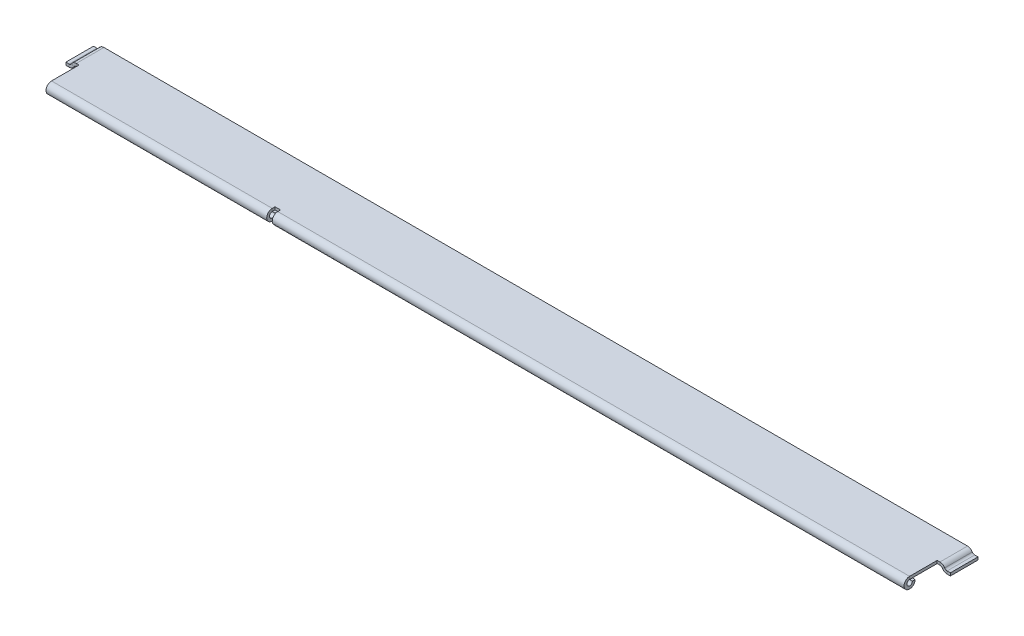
ISO-10303-21;
HEADER;
FILE_DESCRIPTION(('STEP AP214'),'2;1');
FILE_NAME('part.step','',(''),(''),'','','');
FILE_SCHEMA(('AUTOMOTIVE_DESIGN { 1 0 10303 214 1 1 1 1 }'));
ENDSEC;
DATA;
#1=APPLICATION_CONTEXT('core data for automotive mechanical design processes');
#2=APPLICATION_PROTOCOL_DEFINITION('international standard','automotive_design',2000,#1);
#3=PRODUCT_CONTEXT('',#1,'mechanical');
#4=PRODUCT('Part','Part','',(#3));
#5=PRODUCT_RELATED_PRODUCT_CATEGORY('part','',(#4));
#6=PRODUCT_DEFINITION_FORMATION('','',#4);
#7=PRODUCT_DEFINITION_CONTEXT('part definition',#1,'design');
#8=PRODUCT_DEFINITION('design','',#6,#7);
#9=PRODUCT_DEFINITION_SHAPE('','',#8);
#10=(LENGTH_UNIT() NAMED_UNIT(*) SI_UNIT(.MILLI.,.METRE.));
#11=(NAMED_UNIT(*) PLANE_ANGLE_UNIT() SI_UNIT($,.RADIAN.));
#12=(NAMED_UNIT(*) SI_UNIT($,.STERADIAN.) SOLID_ANGLE_UNIT());
#13=UNCERTAINTY_MEASURE_WITH_UNIT(LENGTH_MEASURE(1.E-05),#10,'distance_accuracy_value','');
#14=(GEOMETRIC_REPRESENTATION_CONTEXT(3) GLOBAL_UNCERTAINTY_ASSIGNED_CONTEXT((#13)) GLOBAL_UNIT_ASSIGNED_CONTEXT((#10,
#11,#12)) REPRESENTATION_CONTEXT('',''));
#15=CARTESIAN_POINT('',(0.,0.,0.));
#16=DIRECTION('',(0.,0.,1.));
#17=DIRECTION('',(1.,0.,0.));
#18=AXIS2_PLACEMENT_3D('',#15,#16,#17);
#19=CARTESIAN_POINT('',(155.5,1.,-11.));
#20=DIRECTION('',(0.,-1.,0.));
#21=DIRECTION('',(0.,0.,-1.));
#22=AXIS2_PLACEMENT_3D('',#19,#20,#21);
#23=PLANE('',#22);
#24=DIRECTION('',(0.,0.,-1.));
#25=VECTOR('',#24,1.);
#26=CARTESIAN_POINT('',(-73.5,1.,8.));
#27=LINE('',#26,#25);
#28=CARTESIAN_POINT('',(-73.5,0.999999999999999,9.));
#29=VERTEX_POINT('',#28);
#30=CARTESIAN_POINT('',(-73.5,1.,8.));
#31=VERTEX_POINT('',#30);
#32=EDGE_CURVE('E504',#29,#31,#27,.T.);
#33=ORIENTED_EDGE('',*,*,#32,.F.);
#34=DIRECTION('',(-1.,0.,0.));
#35=VECTOR('',#34,1.);
#36=CARTESIAN_POINT('',(-155.5,0.999999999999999,9.));
#37=LINE('',#36,#35);
#38=CARTESIAN_POINT('',(155.5,0.999999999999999,9.));
#39=VERTEX_POINT('',#38);
#40=EDGE_CURVE('E325',#29,#39,#37,.F.);
#41=ORIENTED_EDGE('',*,*,#40,.T.);
#42=DIRECTION('',(0.,0.,-1.));
#43=VECTOR('',#42,1.);
#44=CARTESIAN_POINT('',(155.5,1.,11.));
#45=LINE('',#44,#43);
#46=CARTESIAN_POINT('',(155.5,1.,-0.999999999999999));
#47=VERTEX_POINT('',#46);
#48=EDGE_CURVE('E330',#39,#47,#45,.T.);
#49=ORIENTED_EDGE('',*,*,#48,.T.);
#50=DIRECTION('',(-1.,0.,0.));
#51=VECTOR('',#50,1.);
#52=CARTESIAN_POINT('',(160.3,1.,-0.999999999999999));
#53=LINE('',#52,#51);
#54=CARTESIAN_POINT('',(156.505299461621,1.,-0.999999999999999));
#55=VERTEX_POINT('',#54);
#56=EDGE_CURVE('E342',#55,#47,#53,.T.);
#57=ORIENTED_EDGE('',*,*,#56,.F.);
#58=DIRECTION('',(0.,0.,1.));
#59=VECTOR('',#58,1.);
#60=CARTESIAN_POINT('',(156.505299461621,1.,-11.));
#61=LINE('',#60,#59);
#62=CARTESIAN_POINT('',(156.505299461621,1.,-11.));
#63=VERTEX_POINT('',#62);
#64=EDGE_CURVE('E356',#63,#55,#61,.T.);
#65=ORIENTED_EDGE('',*,*,#64,.F.);
#66=DIRECTION('',(-1.,0.,0.));
#67=VECTOR('',#66,1.);
#68=CARTESIAN_POINT('',(-155.5,1.,-11.));
#69=LINE('',#68,#67);
#70=CARTESIAN_POINT('',(-156.505299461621,1.00000000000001,-11.));
#71=VERTEX_POINT('',#70);
#72=EDGE_CURVE('E321',#63,#71,#69,.T.);
#73=ORIENTED_EDGE('',*,*,#72,.T.);
#74=DIRECTION('',(0.,0.,1.));
#75=VECTOR('',#74,1.);
#76=CARTESIAN_POINT('',(-156.505299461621,1.,-11.0000000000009));
#77=LINE('',#76,#75);
#78=CARTESIAN_POINT('',(-156.505299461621,1.00000000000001,-0.999999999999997));
#79=VERTEX_POINT('',#78);
#80=EDGE_CURVE('E404',#71,#79,#77,.T.);
#81=ORIENTED_EDGE('',*,*,#80,.T.);
#82=DIRECTION('',(1.,0.,0.));
#83=VECTOR('',#82,1.);
#84=CARTESIAN_POINT('',(-160.3,1.,-0.999999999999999));
#85=LINE('',#84,#83);
#86=CARTESIAN_POINT('',(-155.5,1.,-0.999999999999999));
#87=VERTEX_POINT('',#86);
#88=EDGE_CURVE('E326',#79,#87,#85,.T.);
#89=ORIENTED_EDGE('',*,*,#88,.T.);
#90=DIRECTION('',(0.,0.,1.));
#91=VECTOR('',#90,1.);
#92=CARTESIAN_POINT('',(-155.5,1.,11.));
#93=LINE('',#92,#91);
#94=CARTESIAN_POINT('',(-155.5,1.,9.));
#95=VERTEX_POINT('',#94);
#96=EDGE_CURVE('E322',#87,#95,#93,.T.);
#97=ORIENTED_EDGE('',*,*,#96,.T.);
#98=CARTESIAN_POINT('',(-75.5,1.,9.));
#99=VERTEX_POINT('',#98);
#100=EDGE_CURVE('E327',#95,#99,#37,.F.);
#101=ORIENTED_EDGE('',*,*,#100,.T.);
#102=DIRECTION('',(0.,0.,1.));
#103=VECTOR('',#102,1.);
#104=CARTESIAN_POINT('',(-75.5,1.,8.));
#105=LINE('',#104,#103);
#106=CARTESIAN_POINT('',(-75.5,1.,8.));
#107=VERTEX_POINT('',#106);
#108=EDGE_CURVE('E510',#107,#99,#105,.T.);
#109=ORIENTED_EDGE('',*,*,#108,.F.);
#110=DIRECTION('',(-1.,0.,0.));
#111=VECTOR('',#110,1.);
#112=CARTESIAN_POINT('',(-75.5,1.,8.));
#113=LINE('',#112,#111);
#114=EDGE_CURVE('E506',#31,#107,#113,.T.);
#115=ORIENTED_EDGE('',*,*,#114,.F.);
#116=EDGE_LOOP('',(#33,#41,#49,#57,#65,#73,#81,#89,#97,#101,#109,#115));
#117=FACE_BOUND('',#116,.T.);
#118=ADVANCED_FACE('F50',(#117),#23,.F.);
#119=CARTESIAN_POINT('',(0.,-1.,8.));
#120=DIRECTION('',(0.,-1.,0.));
#121=DIRECTION('',(-1.,0.,0.));
#122=AXIS2_PLACEMENT_3D('',#119,#120,#121);
#123=PLANE('',#122);
#124=DIRECTION('',(-1.,0.,0.));
#125=VECTOR('',#124,1.);
#126=CARTESIAN_POINT('',(-155.5,-1.,7.));
#127=LINE('',#126,#125);
#128=CARTESIAN_POINT('',(155.5,-1.,7.));
#129=VERTEX_POINT('',#128);
#130=CARTESIAN_POINT('',(-73.5,-1.,7.));
#131=VERTEX_POINT('',#130);
#132=EDGE_CURVE('E274',#129,#131,#127,.T.);
#133=ORIENTED_EDGE('',*,*,#132,.T.);
#134=DIRECTION('',(0.,0.,1.));
#135=VECTOR('',#134,1.);
#136=CARTESIAN_POINT('',(-73.5,-1.,8.));
#137=LINE('',#136,#135);
#138=CARTESIAN_POINT('',(-73.5,-1.,8.));
#139=VERTEX_POINT('',#138);
#140=EDGE_CURVE('E259',#139,#131,#137,.F.);
#141=ORIENTED_EDGE('',*,*,#140,.F.);
#142=DIRECTION('',(-1.,0.,0.));
#143=VECTOR('',#142,1.);
#144=CARTESIAN_POINT('',(-155.5,-1.,8.));
#145=LINE('',#144,#143);
#146=CARTESIAN_POINT('',(155.5,-1.,8.));
#147=VERTEX_POINT('',#146);
#148=EDGE_CURVE('E297',#147,#139,#145,.T.);
#149=ORIENTED_EDGE('',*,*,#148,.F.);
#150=DIRECTION('',(0.,0.,-1.));
#151=VECTOR('',#150,1.);
#152=CARTESIAN_POINT('',(155.5,-1.,8.));
#153=LINE('',#152,#151);
#154=EDGE_CURVE('E275',#147,#129,#153,.T.);
#155=ORIENTED_EDGE('',*,*,#154,.T.);
#156=EDGE_LOOP('',(#133,#141,#149,#155));
#157=FACE_BOUND('',#156,.T.);
#158=ADVANCED_FACE('F486',(#157),#123,.F.);
#159=CARTESIAN_POINT('',(-75.5,-1.,8.));
#160=VERTEX_POINT('',#159);
#161=CARTESIAN_POINT('',(-155.5,-1.,8.));
#162=VERTEX_POINT('',#161);
#163=EDGE_CURVE('E267',#160,#162,#145,.T.);
#164=ORIENTED_EDGE('',*,*,#163,.F.);
#165=DIRECTION('',(0.,0.,1.));
#166=VECTOR('',#165,1.);
#167=CARTESIAN_POINT('',(-75.5,-1.,8.));
#168=LINE('',#167,#166);
#169=CARTESIAN_POINT('',(-75.5,-1.,7.));
#170=VERTEX_POINT('',#169);
#171=EDGE_CURVE('E252',#160,#170,#168,.F.);
#172=ORIENTED_EDGE('',*,*,#171,.T.);
#173=CARTESIAN_POINT('',(-155.5,-1.,7.));
#174=VERTEX_POINT('',#173);
#175=EDGE_CURVE('E265',#170,#174,#127,.T.);
#176=ORIENTED_EDGE('',*,*,#175,.T.);
#177=DIRECTION('',(0.,0.,-1.));
#178=VECTOR('',#177,1.);
#179=CARTESIAN_POINT('',(-155.5,-1.,8.));
#180=LINE('',#179,#178);
#181=EDGE_CURVE('E280',#162,#174,#180,.T.);
#182=ORIENTED_EDGE('',*,*,#181,.F.);
#183=EDGE_LOOP('',(#164,#172,#176,#182));
#184=FACE_BOUND('',#183,.T.);
#185=ADVANCED_FACE('F263',(#184),#123,.F.);
#186=CARTESIAN_POINT('',(-155.5,-1.,9.));
#187=DIRECTION('',(-1.,0.,0.));
#188=DIRECTION('',(0.,0.,-1.));
#189=AXIS2_PLACEMENT_3D('',#186,#187,#188);
#190=CYLINDRICAL_SURFACE('',#189,0.999999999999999);
#191=CARTESIAN_POINT('',(-73.5,-1.,9.));
#192=DIRECTION('',(-1.,0.,0.));
#193=DIRECTION('',(0.,0.,1.));
#194=AXIS2_PLACEMENT_3D('',#191,#192,#193);
#195=CIRCLE('',#194,0.999999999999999);
#196=CARTESIAN_POINT('',(-73.5,0.,9.));
#197=VERTEX_POINT('',#196);
#198=EDGE_CURVE('E492',#139,#197,#195,.T.);
#199=ORIENTED_EDGE('',*,*,#198,.T.);
#200=DIRECTION('',(-1.,0.,0.));
#201=VECTOR('',#200,1.);
#202=CARTESIAN_POINT('',(-155.5,0.,9.));
#203=LINE('',#202,#201);
#204=CARTESIAN_POINT('',(155.5,0.,9.));
#205=VERTEX_POINT('',#204);
#206=EDGE_CURVE('E289',#197,#205,#203,.F.);
#207=ORIENTED_EDGE('',*,*,#206,.T.);
#208=CARTESIAN_POINT('',(155.5,-1.,9.));
#209=DIRECTION('',(-1.,0.,0.));
#210=DIRECTION('',(0.,0.,1.));
#211=AXIS2_PLACEMENT_3D('',#208,#209,#210);
#212=CIRCLE('',#211,0.999999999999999);
#213=EDGE_CURVE('E294',#205,#147,#212,.F.);
#214=ORIENTED_EDGE('',*,*,#213,.T.);
#215=ORIENTED_EDGE('',*,*,#148,.T.);
#216=EDGE_LOOP('',(#199,#207,#214,#215));
#217=FACE_BOUND('',#216,.T.);
#218=ADVANCED_FACE('F489',(#217),#190,.F.);
#219=CARTESIAN_POINT('',(-75.5,-1.,9.));
#220=DIRECTION('',(-1.,0.,0.));
#221=DIRECTION('',(0.,0.,1.));
#222=AXIS2_PLACEMENT_3D('',#219,#220,#221);
#223=CIRCLE('',#222,0.999999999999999);
#224=CARTESIAN_POINT('',(-75.5,0.,9.));
#225=VERTEX_POINT('',#224);
#226=EDGE_CURVE('E615',#225,#160,#223,.F.);
#227=ORIENTED_EDGE('',*,*,#226,.T.);
#228=ORIENTED_EDGE('',*,*,#163,.T.);
#229=CARTESIAN_POINT('',(-155.5,-1.,9.));
#230=DIRECTION('',(-1.,0.,0.));
#231=DIRECTION('',(0.,0.,1.));
#232=AXIS2_PLACEMENT_3D('',#229,#230,#231);
#233=CIRCLE('',#232,0.999999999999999);
#234=CARTESIAN_POINT('',(-155.5,0.,9.));
#235=VERTEX_POINT('',#234);
#236=EDGE_CURVE('E300',#162,#235,#233,.T.);
#237=ORIENTED_EDGE('',*,*,#236,.T.);
#238=EDGE_CURVE('E290',#235,#225,#203,.F.);
#239=ORIENTED_EDGE('',*,*,#238,.T.);
#240=EDGE_LOOP('',(#227,#228,#237,#239));
#241=FACE_BOUND('',#240,.T.);
#242=ADVANCED_FACE('F614',(#241),#190,.F.);
#243=CARTESIAN_POINT('',(-155.5,-1.,9.));
#244=DIRECTION('',(-1.,0.,0.));
#245=DIRECTION('',(0.,0.,-1.));
#246=AXIS2_PLACEMENT_3D('',#243,#244,#245);
#247=CYLINDRICAL_SURFACE('',#246,2.);
#248=ORIENTED_EDGE('',*,*,#40,.F.);
#249=CARTESIAN_POINT('',(-73.5,-1.,9.));
#250=DIRECTION('',(1.,0.,0.));
#251=DIRECTION('',(0.,0.,-1.));
#252=AXIS2_PLACEMENT_3D('',#249,#250,#251);
#253=CIRCLE('',#252,2.);
#254=EDGE_CURVE('E258',#131,#29,#253,.F.);
#255=ORIENTED_EDGE('',*,*,#254,.F.);
#256=ORIENTED_EDGE('',*,*,#132,.F.);
#257=CARTESIAN_POINT('',(155.5,-1.,9.));
#258=DIRECTION('',(-1.,0.,0.));
#259=DIRECTION('',(0.,0.,1.));
#260=AXIS2_PLACEMENT_3D('',#257,#258,#259);
#261=CIRCLE('',#260,2.);
#262=EDGE_CURVE('E281',#39,#129,#261,.F.);
#263=ORIENTED_EDGE('',*,*,#262,.F.);
#264=EDGE_LOOP('',(#248,#255,#256,#263));
#265=FACE_BOUND('',#264,.T.);
#266=ADVANCED_FACE('F481',(#265),#247,.T.);
#267=ORIENTED_EDGE('',*,*,#175,.F.);
#268=CARTESIAN_POINT('',(-75.5,-1.,9.));
#269=DIRECTION('',(-1.,0.,0.));
#270=DIRECTION('',(0.,0.,1.));
#271=AXIS2_PLACEMENT_3D('',#268,#269,#270);
#272=CIRCLE('',#271,2.);
#273=EDGE_CURVE('E249',#99,#170,#272,.F.);
#274=ORIENTED_EDGE('',*,*,#273,.F.);
#275=ORIENTED_EDGE('',*,*,#100,.F.);
#276=CARTESIAN_POINT('',(-155.5,-1.,9.));
#277=DIRECTION('',(-1.,0.,0.));
#278=DIRECTION('',(0.,0.,1.));
#279=AXIS2_PLACEMENT_3D('',#276,#277,#278);
#280=CIRCLE('',#279,2.);
#281=EDGE_CURVE('E272',#174,#95,#280,.T.);
#282=ORIENTED_EDGE('',*,*,#281,.F.);
#283=EDGE_LOOP('',(#267,#274,#275,#282));
#284=FACE_BOUND('',#283,.T.);
#285=ADVANCED_FACE('F270',(#284),#247,.T.);
#286=CARTESIAN_POINT('',(155.5,0.,-11.));
#287=DIRECTION('',(0.,-1.,0.));
#288=DIRECTION('',(0.,0.,-1.));
#289=AXIS2_PLACEMENT_3D('',#286,#287,#288);
#290=PLANE('',#289);
#291=ORIENTED_EDGE('',*,*,#206,.F.);
#292=DIRECTION('',(0.,0.,-1.));
#293=VECTOR('',#292,1.);
#294=CARTESIAN_POINT('',(-73.5,0.,-11.));
#295=LINE('',#294,#293);
#296=CARTESIAN_POINT('',(-73.5,0.,8.));
#297=VERTEX_POINT('',#296);
#298=EDGE_CURVE('E623',#197,#297,#295,.T.);
#299=ORIENTED_EDGE('',*,*,#298,.T.);
#300=DIRECTION('',(1.,0.,0.));
#301=VECTOR('',#300,1.);
#302=CARTESIAN_POINT('',(155.5,0.,8.));
#303=LINE('',#302,#301);
#304=CARTESIAN_POINT('',(-75.5,0.,8.));
#305=VERTEX_POINT('',#304);
#306=EDGE_CURVE('E527',#297,#305,#303,.F.);
#307=ORIENTED_EDGE('',*,*,#306,.T.);
#308=DIRECTION('',(0.,0.,-1.));
#309=VECTOR('',#308,1.);
#310=CARTESIAN_POINT('',(-75.5,0.,-11.));
#311=LINE('',#310,#309);
#312=EDGE_CURVE('E512',#305,#225,#311,.F.);
#313=ORIENTED_EDGE('',*,*,#312,.T.);
#314=ORIENTED_EDGE('',*,*,#238,.F.);
#315=DIRECTION('',(0.,0.,1.));
#316=VECTOR('',#315,1.);
#317=CARTESIAN_POINT('',(-155.5,0.,11.));
#318=LINE('',#317,#316);
#319=CARTESIAN_POINT('',(-155.5,0.,-0.999999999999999));
#320=VERTEX_POINT('',#319);
#321=EDGE_CURVE('E310',#320,#235,#318,.T.);
#322=ORIENTED_EDGE('',*,*,#321,.F.);
#323=DIRECTION('',(1.,0.,0.));
#324=VECTOR('',#323,1.);
#325=CARTESIAN_POINT('',(-160.3,0.,-0.999999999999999));
#326=LINE('',#325,#324);
#327=CARTESIAN_POINT('',(-156.505299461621,0.,-0.999999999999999));
#328=VERTEX_POINT('',#327);
#329=EDGE_CURVE('E316',#328,#320,#326,.T.);
#330=ORIENTED_EDGE('',*,*,#329,.F.);
#331=DIRECTION('',(0.,0.,1.));
#332=VECTOR('',#331,1.);
#333=CARTESIAN_POINT('',(-156.505299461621,0.,-11.0000000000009));
#334=LINE('',#333,#332);
#335=CARTESIAN_POINT('',(-156.505299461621,0.,-11.));
#336=VERTEX_POINT('',#335);
#337=EDGE_CURVE('E411',#336,#328,#334,.T.);
#338=ORIENTED_EDGE('',*,*,#337,.F.);
#339=DIRECTION('',(-1.,0.,0.));
#340=VECTOR('',#339,1.);
#341=CARTESIAN_POINT('',(-155.5,0.,-11.));
#342=LINE('',#341,#340);
#343=CARTESIAN_POINT('',(156.505299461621,0.,-11.));
#344=VERTEX_POINT('',#343);
#345=EDGE_CURVE('E333',#344,#336,#342,.T.);
#346=ORIENTED_EDGE('',*,*,#345,.F.);
#347=DIRECTION('',(0.,0.,1.));
#348=VECTOR('',#347,1.);
#349=CARTESIAN_POINT('',(156.505299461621,0.,-11.));
#350=LINE('',#349,#348);
#351=CARTESIAN_POINT('',(156.505299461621,0.,-0.999999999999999));
#352=VERTEX_POINT('',#351);
#353=EDGE_CURVE('E334',#344,#352,#350,.T.);
#354=ORIENTED_EDGE('',*,*,#353,.T.);
#355=DIRECTION('',(-1.,0.,0.));
#356=VECTOR('',#355,1.);
#357=CARTESIAN_POINT('',(160.3,0.,-0.999999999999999));
#358=LINE('',#357,#356);
#359=CARTESIAN_POINT('',(155.5,0.,-0.999999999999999));
#360=VERTEX_POINT('',#359);
#361=EDGE_CURVE('E337',#352,#360,#358,.T.);
#362=ORIENTED_EDGE('',*,*,#361,.T.);
#363=DIRECTION('',(0.,0.,-1.));
#364=VECTOR('',#363,1.);
#365=CARTESIAN_POINT('',(155.5,0.,11.));
#366=LINE('',#365,#364);
#367=EDGE_CURVE('E304',#205,#360,#366,.T.);
#368=ORIENTED_EDGE('',*,*,#367,.F.);
#369=EDGE_LOOP('',(#291,#299,#307,#313,#314,#322,#330,#338,#346,#354,#362,#368));
#370=FACE_BOUND('',#369,.T.);
#371=ADVANCED_FACE('F495',(#370),#290,.T.);
#372=CARTESIAN_POINT('',(-155.5,1.,-11.));
#373=DIRECTION('',(0.,0.,1.));
#374=DIRECTION('',(1.,0.,0.));
#375=AXIS2_PLACEMENT_3D('',#372,#373,#374);
#376=PLANE('',#375);
#377=ORIENTED_EDGE('',*,*,#345,.T.);
#378=DIRECTION('',(0.,1.,0.));
#379=VECTOR('',#378,1.);
#380=CARTESIAN_POINT('',(-156.505299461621,1.,-11.));
#381=LINE('',#380,#379);
#382=EDGE_CURVE('E408',#336,#71,#381,.T.);
#383=ORIENTED_EDGE('',*,*,#382,.T.);
#384=ORIENTED_EDGE('',*,*,#72,.F.);
#385=DIRECTION('',(0.,1.,0.));
#386=VECTOR('',#385,1.);
#387=CARTESIAN_POINT('',(156.505299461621,1.,-11.));
#388=LINE('',#387,#386);
#389=EDGE_CURVE('E347',#344,#63,#388,.T.);
#390=ORIENTED_EDGE('',*,*,#389,.F.);
#391=EDGE_LOOP('',(#377,#383,#384,#390));
#392=FACE_BOUND('',#391,.T.);
#393=ADVANCED_FACE('F599',(#392),#376,.F.);
#394=CARTESIAN_POINT('',(-160.3,1.,-0.999999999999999));
#395=DIRECTION('',(0.,0.,-1.));
#396=DIRECTION('',(0.,1.,0.));
#397=AXIS2_PLACEMENT_3D('',#394,#395,#396);
#398=PLANE('',#397);
#399=ORIENTED_EDGE('',*,*,#88,.F.);
#400=DIRECTION('',(0.,-1.,0.));
#401=VECTOR('',#400,1.);
#402=CARTESIAN_POINT('',(-156.505299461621,1.,-0.999999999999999));
#403=LINE('',#402,#401);
#404=EDGE_CURVE('E414',#79,#328,#403,.T.);
#405=ORIENTED_EDGE('',*,*,#404,.T.);
#406=ORIENTED_EDGE('',*,*,#329,.T.);
#407=DIRECTION('',(0.,1.,0.));
#408=VECTOR('',#407,1.);
#409=CARTESIAN_POINT('',(-155.5,1.,-0.999999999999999));
#410=LINE('',#409,#408);
#411=EDGE_CURVE('E317',#320,#87,#410,.T.);
#412=ORIENTED_EDGE('',*,*,#411,.T.);
#413=EDGE_LOOP('',(#399,#405,#406,#412));
#414=FACE_BOUND('',#413,.T.);
#415=ADVANCED_FACE('F605',(#414),#398,.F.);
#416=CARTESIAN_POINT('',(155.5,-1.,9.));
#417=DIRECTION('',(1.,0.,0.));
#418=DIRECTION('',(0.,0.,-1.));
#419=AXIS2_PLACEMENT_3D('',#416,#417,#418);
#420=PLANE('',#419);
#421=ORIENTED_EDGE('',*,*,#154,.F.);
#422=ORIENTED_EDGE('',*,*,#213,.F.);
#423=DIRECTION('',(0.,1.,0.));
#424=VECTOR('',#423,1.);
#425=CARTESIAN_POINT('',(155.5,0.,9.));
#426=LINE('',#425,#424);
#427=EDGE_CURVE('E469',#205,#39,#426,.T.);
#428=ORIENTED_EDGE('',*,*,#427,.T.);
#429=ORIENTED_EDGE('',*,*,#262,.T.);
#430=EDGE_LOOP('',(#421,#422,#428,#429));
#431=FACE_BOUND('',#430,.T.);
#432=ADVANCED_FACE('F474',(#431),#420,.T.);
#433=CARTESIAN_POINT('',(-155.5,-1.,9.));
#434=DIRECTION('',(1.,0.,0.));
#435=DIRECTION('',(0.,0.,-1.));
#436=AXIS2_PLACEMENT_3D('',#433,#434,#435);
#437=PLANE('',#436);
#438=ORIENTED_EDGE('',*,*,#236,.F.);
#439=ORIENTED_EDGE('',*,*,#181,.T.);
#440=ORIENTED_EDGE('',*,*,#281,.T.);
#441=DIRECTION('',(0.,1.,0.));
#442=VECTOR('',#441,1.);
#443=CARTESIAN_POINT('',(-155.5,0.,9.));
#444=LINE('',#443,#442);
#445=EDGE_CURVE('E312',#235,#95,#444,.T.);
#446=ORIENTED_EDGE('',*,*,#445,.F.);
#447=EDGE_LOOP('',(#438,#439,#440,#446));
#448=FACE_BOUND('',#447,.T.);
#449=ADVANCED_FACE('F612',(#448),#437,.F.);
#450=CARTESIAN_POINT('',(155.5,1.,11.));
#451=DIRECTION('',(-1.,0.,0.));
#452=DIRECTION('',(0.,0.,1.));
#453=AXIS2_PLACEMENT_3D('',#450,#451,#452);
#454=PLANE('',#453);
#455=ORIENTED_EDGE('',*,*,#367,.T.);
#456=DIRECTION('',(0.,1.,0.));
#457=VECTOR('',#456,1.);
#458=CARTESIAN_POINT('',(155.5,1.,-0.999999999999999));
#459=LINE('',#458,#457);
#460=EDGE_CURVE('E307',#360,#47,#459,.T.);
#461=ORIENTED_EDGE('',*,*,#460,.T.);
#462=ORIENTED_EDGE('',*,*,#48,.F.);
#463=ORIENTED_EDGE('',*,*,#427,.F.);
#464=EDGE_LOOP('',(#455,#461,#462,#463));
#465=FACE_BOUND('',#464,.T.);
#466=ADVANCED_FACE('F499',(#465),#454,.F.);
#467=CARTESIAN_POINT('',(-155.5,1.,11.));
#468=DIRECTION('',(1.,0.,0.));
#469=DIRECTION('',(0.,0.,-1.));
#470=AXIS2_PLACEMENT_3D('',#467,#468,#469);
#471=PLANE('',#470);
#472=ORIENTED_EDGE('',*,*,#411,.F.);
#473=ORIENTED_EDGE('',*,*,#321,.T.);
#474=ORIENTED_EDGE('',*,*,#445,.T.);
#475=ORIENTED_EDGE('',*,*,#96,.F.);
#476=EDGE_LOOP('',(#472,#473,#474,#475));
#477=FACE_BOUND('',#476,.T.);
#478=ADVANCED_FACE('F608',(#477),#471,.F.);
#479=CARTESIAN_POINT('',(160.3,1.,-0.999999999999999));
#480=DIRECTION('',(0.,0.,1.));
#481=DIRECTION('',(0.,-1.,0.));
#482=AXIS2_PLACEMENT_3D('',#479,#480,#481);
#483=PLANE('',#482);
#484=ORIENTED_EDGE('',*,*,#361,.F.);
#485=DIRECTION('',(0.,1.,0.));
#486=VECTOR('',#485,1.);
#487=CARTESIAN_POINT('',(156.505299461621,1.,-0.999999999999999));
#488=LINE('',#487,#486);
#489=EDGE_CURVE('E339',#352,#55,#488,.T.);
#490=ORIENTED_EDGE('',*,*,#489,.T.);
#491=ORIENTED_EDGE('',*,*,#56,.T.);
#492=ORIENTED_EDGE('',*,*,#460,.F.);
#493=EDGE_LOOP('',(#484,#490,#491,#492));
#494=FACE_BOUND('',#493,.T.);
#495=ADVANCED_FACE('F655',(#494),#483,.T.);
#496=CARTESIAN_POINT('',(156.505299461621,-1.,-11.));
#497=DIRECTION('',(0.,0.,-1.));
#498=DIRECTION('',(-1.,0.,0.));
#499=AXIS2_PLACEMENT_3D('',#496,#497,#498);
#500=PLANE('',#499);
#501=DIRECTION('',(0.86602540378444,0.499999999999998,0.));
#502=VECTOR('',#501,1.);
#503=CARTESIAN_POINT('',(158.23735026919,0.,-11.));
#504=LINE('',#503,#502);
#505=CARTESIAN_POINT('',(157.371324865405,-0.5,-11.));
#506=VERTEX_POINT('',#505);
#507=CARTESIAN_POINT('',(158.23735026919,0.,-11.));
#508=VERTEX_POINT('',#507);
#509=EDGE_CURVE('E361',#506,#508,#504,.T.);
#510=ORIENTED_EDGE('',*,*,#509,.F.);
#511=CARTESIAN_POINT('',(156.505299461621,-1.,-11.));
#512=DIRECTION('',(0.,0.,-1.));
#513=DIRECTION('',(-1.,0.,0.));
#514=AXIS2_PLACEMENT_3D('',#511,#512,#513);
#515=CIRCLE('',#514,1.);
#516=EDGE_CURVE('E344',#506,#344,#515,.F.);
#517=ORIENTED_EDGE('',*,*,#516,.T.);
#518=ORIENTED_EDGE('',*,*,#389,.T.);
#519=CARTESIAN_POINT('',(156.505299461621,-1.,-11.));
#520=DIRECTION('',(0.,0.,1.));
#521=DIRECTION('',(1.,0.,0.));
#522=AXIS2_PLACEMENT_3D('',#519,#520,#521);
#523=CIRCLE('',#522,2.);
#524=EDGE_CURVE('E353',#508,#63,#523,.T.);
#525=ORIENTED_EDGE('',*,*,#524,.F.);
#526=EDGE_LOOP('',(#510,#517,#518,#525));
#527=FACE_BOUND('',#526,.T.);
#528=ADVANCED_FACE('F651',(#527),#500,.T.);
#529=CARTESIAN_POINT('',(156.505299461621,-1.,-0.999999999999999));
#530=DIRECTION('',(0.,0.,1.));
#531=DIRECTION('',(1.,0.,0.));
#532=AXIS2_PLACEMENT_3D('',#529,#530,#531);
#533=PLANE('',#532);
#534=ORIENTED_EDGE('',*,*,#489,.F.);
#535=CARTESIAN_POINT('',(156.505299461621,-1.,-0.999999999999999));
#536=DIRECTION('',(0.,0.,-1.));
#537=DIRECTION('',(-1.,0.,0.));
#538=AXIS2_PLACEMENT_3D('',#535,#536,#537);
#539=CIRCLE('',#538,1.);
#540=CARTESIAN_POINT('',(157.371324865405,-0.5,-0.999999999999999));
#541=VERTEX_POINT('',#540);
#542=EDGE_CURVE('E348',#352,#541,#539,.T.);
#543=ORIENTED_EDGE('',*,*,#542,.T.);
#544=DIRECTION('',(0.86602540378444,0.499999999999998,0.));
#545=VECTOR('',#544,1.);
#546=CARTESIAN_POINT('',(158.23735026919,0.,-0.999999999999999));
#547=LINE('',#546,#545);
#548=CARTESIAN_POINT('',(158.23735026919,0.,-0.999999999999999));
#549=VERTEX_POINT('',#548);
#550=EDGE_CURVE('E350',#541,#549,#547,.T.);
#551=ORIENTED_EDGE('',*,*,#550,.T.);
#552=CARTESIAN_POINT('',(156.505299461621,-1.,-0.999999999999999));
#553=DIRECTION('',(0.,0.,-1.));
#554=DIRECTION('',(1.,0.,0.));
#555=AXIS2_PLACEMENT_3D('',#552,#553,#554);
#556=CIRCLE('',#555,2.);
#557=EDGE_CURVE('E351',#55,#549,#556,.T.);
#558=ORIENTED_EDGE('',*,*,#557,.F.);
#559=EDGE_LOOP('',(#534,#543,#551,#558));
#560=FACE_BOUND('',#559,.T.);
#561=ADVANCED_FACE('F654',(#560),#533,.T.);
#562=CARTESIAN_POINT('',(156.505299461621,-1.,4.14546378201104));
#563=DIRECTION('',(0.,0.,-1.));
#564=DIRECTION('',(-1.,0.,0.));
#565=AXIS2_PLACEMENT_3D('',#562,#563,#564);
#566=CYLINDRICAL_SURFACE('',#565,2.);
#567=ORIENTED_EDGE('',*,*,#557,.T.);
#568=DIRECTION('',(0.,0.,1.));
#569=VECTOR('',#568,1.);
#570=CARTESIAN_POINT('',(158.23735026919,0.,-11.));
#571=LINE('',#570,#569);
#572=EDGE_CURVE('E370',#508,#549,#571,.T.);
#573=ORIENTED_EDGE('',*,*,#572,.F.);
#574=ORIENTED_EDGE('',*,*,#524,.T.);
#575=ORIENTED_EDGE('',*,*,#64,.T.);
#576=EDGE_LOOP('',(#567,#573,#574,#575));
#577=FACE_BOUND('',#576,.T.);
#578=ADVANCED_FACE('F659',(#577),#566,.T.);
#579=CARTESIAN_POINT('',(156.505299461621,-1.,4.14546378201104));
#580=DIRECTION('',(0.,0.,-1.));
#581=DIRECTION('',(-1.,0.,0.));
#582=AXIS2_PLACEMENT_3D('',#579,#580,#581);
#583=CYLINDRICAL_SURFACE('',#582,1.);
#584=ORIENTED_EDGE('',*,*,#542,.F.);
#585=ORIENTED_EDGE('',*,*,#353,.F.);
#586=ORIENTED_EDGE('',*,*,#516,.F.);
#587=DIRECTION('',(0.,0.,1.));
#588=VECTOR('',#587,1.);
#589=CARTESIAN_POINT('',(157.371324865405,-0.5,-11.));
#590=LINE('',#589,#588);
#591=EDGE_CURVE('E365',#506,#541,#590,.T.);
#592=ORIENTED_EDGE('',*,*,#591,.T.);
#593=EDGE_LOOP('',(#584,#585,#586,#592));
#594=FACE_BOUND('',#593,.T.);
#595=ADVANCED_FACE('F661',(#594),#583,.F.);
#596=CARTESIAN_POINT('',(159.103375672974,0.499999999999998,-11.));
#597=DIRECTION('',(0.,0.,1.));
#598=DIRECTION('',(1.,0.,0.));
#599=AXIS2_PLACEMENT_3D('',#596,#597,#598);
#600=PLANE('',#599);
#601=DIRECTION('',(0.,1.,0.));
#602=VECTOR('',#601,1.);
#603=CARTESIAN_POINT('',(159.103375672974,-0.5,-11.));
#604=LINE('',#603,#602);
#605=CARTESIAN_POINT('',(159.103375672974,-1.5,-11.));
#606=VERTEX_POINT('',#605);
#607=CARTESIAN_POINT('',(159.103375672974,-0.500000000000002,-11.));
#608=VERTEX_POINT('',#607);
#609=EDGE_CURVE('E399',#606,#608,#604,.T.);
#610=ORIENTED_EDGE('',*,*,#609,.F.);
#611=CARTESIAN_POINT('',(159.103375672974,0.499999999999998,-11.));
#612=DIRECTION('',(0.,0.,-1.));
#613=DIRECTION('',(-1.,0.,0.));
#614=AXIS2_PLACEMENT_3D('',#611,#612,#613);
#615=CIRCLE('',#614,2.);
#616=EDGE_CURVE('E362',#606,#506,#615,.T.);
#617=ORIENTED_EDGE('',*,*,#616,.T.);
#618=ORIENTED_EDGE('',*,*,#509,.T.);
#619=CARTESIAN_POINT('',(159.103375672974,0.499999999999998,-11.));
#620=DIRECTION('',(0.,0.,-1.));
#621=DIRECTION('',(-1.,0.,0.));
#622=AXIS2_PLACEMENT_3D('',#619,#620,#621);
#623=CIRCLE('',#622,1.);
#624=EDGE_CURVE('E369',#608,#508,#623,.T.);
#625=ORIENTED_EDGE('',*,*,#624,.F.);
#626=EDGE_LOOP('',(#610,#617,#618,#625));
#627=FACE_BOUND('',#626,.T.);
#628=ADVANCED_FACE('F664',(#627),#600,.F.);
#629=CARTESIAN_POINT('',(159.103375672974,0.499999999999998,-0.999999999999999));
#630=DIRECTION('',(0.,0.,-1.));
#631=DIRECTION('',(-1.,0.,0.));
#632=AXIS2_PLACEMENT_3D('',#629,#630,#631);
#633=PLANE('',#632);
#634=CARTESIAN_POINT('',(159.103375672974,0.499999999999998,-0.999999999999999));
#635=DIRECTION('',(0.,0.,-1.));
#636=DIRECTION('',(-1.,0.,0.));
#637=AXIS2_PLACEMENT_3D('',#634,#635,#636);
#638=CIRCLE('',#637,2.);
#639=CARTESIAN_POINT('',(159.103375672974,-1.5,-0.999999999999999));
#640=VERTEX_POINT('',#639);
#641=EDGE_CURVE('E357',#541,#640,#638,.F.);
#642=ORIENTED_EDGE('',*,*,#641,.T.);
#643=DIRECTION('',(0.,1.,0.));
#644=VECTOR('',#643,1.);
#645=CARTESIAN_POINT('',(159.103375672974,-0.5,-0.999999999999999));
#646=LINE('',#645,#644);
#647=CARTESIAN_POINT('',(159.103375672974,-0.5,-0.999999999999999));
#648=VERTEX_POINT('',#647);
#649=EDGE_CURVE('E360',#640,#648,#646,.T.);
#650=ORIENTED_EDGE('',*,*,#649,.T.);
#651=CARTESIAN_POINT('',(159.103375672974,0.499999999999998,-0.999999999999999));
#652=DIRECTION('',(0.,0.,1.));
#653=DIRECTION('',(-1.,0.,0.));
#654=AXIS2_PLACEMENT_3D('',#651,#652,#653);
#655=CIRCLE('',#654,1.);
#656=EDGE_CURVE('E366',#549,#648,#655,.T.);
#657=ORIENTED_EDGE('',*,*,#656,.F.);
#658=ORIENTED_EDGE('',*,*,#550,.F.);
#659=EDGE_LOOP('',(#642,#650,#657,#658));
#660=FACE_BOUND('',#659,.T.);
#661=ADVANCED_FACE('F669',(#660),#633,.F.);
#662=CARTESIAN_POINT('',(159.103375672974,0.499999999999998,4.26337900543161));
#663=DIRECTION('',(0.,0.,-1.));
#664=DIRECTION('',(-1.,0.,0.));
#665=AXIS2_PLACEMENT_3D('',#662,#663,#664);
#666=CYLINDRICAL_SURFACE('',#665,1.);
#667=ORIENTED_EDGE('',*,*,#572,.T.);
#668=ORIENTED_EDGE('',*,*,#656,.T.);
#669=DIRECTION('',(0.,0.,1.));
#670=VECTOR('',#669,1.);
#671=CARTESIAN_POINT('',(159.103375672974,-0.5,-11.));
#672=LINE('',#671,#670);
#673=EDGE_CURVE('E381',#608,#648,#672,.T.);
#674=ORIENTED_EDGE('',*,*,#673,.F.);
#675=ORIENTED_EDGE('',*,*,#624,.T.);
#676=EDGE_LOOP('',(#667,#668,#674,#675));
#677=FACE_BOUND('',#676,.T.);
#678=ADVANCED_FACE('F672',(#677),#666,.F.);
#679=CARTESIAN_POINT('',(159.103375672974,0.499999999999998,4.26337900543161));
#680=DIRECTION('',(0.,0.,-1.));
#681=DIRECTION('',(-1.,0.,0.));
#682=AXIS2_PLACEMENT_3D('',#679,#680,#681);
#683=CYLINDRICAL_SURFACE('',#682,2.);
#684=ORIENTED_EDGE('',*,*,#591,.F.);
#685=ORIENTED_EDGE('',*,*,#616,.F.);
#686=DIRECTION('',(0.,0.,1.));
#687=VECTOR('',#686,1.);
#688=CARTESIAN_POINT('',(159.103375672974,-1.5,-11.));
#689=LINE('',#688,#687);
#690=EDGE_CURVE('E373',#606,#640,#689,.T.);
#691=ORIENTED_EDGE('',*,*,#690,.T.);
#692=ORIENTED_EDGE('',*,*,#641,.F.);
#693=EDGE_LOOP('',(#684,#685,#691,#692));
#694=FACE_BOUND('',#693,.T.);
#695=ADVANCED_FACE('F674',(#694),#683,.T.);
#696=CARTESIAN_POINT('',(160.3,-1.5,-11.));
#697=DIRECTION('',(1.,0.,0.));
#698=DIRECTION('',(0.,0.,1.));
#699=AXIS2_PLACEMENT_3D('',#696,#697,#698);
#700=PLANE('',#699);
#701=DIRECTION('',(0.,-1.,0.));
#702=VECTOR('',#701,1.);
#703=CARTESIAN_POINT('',(160.3,-0.499999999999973,-11.));
#704=LINE('',#703,#702);
#705=CARTESIAN_POINT('',(160.3,-0.499999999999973,-11.));
#706=VERTEX_POINT('',#705);
#707=CARTESIAN_POINT('',(160.3,-1.5,-11.));
#708=VERTEX_POINT('',#707);
#709=EDGE_CURVE('E401',#706,#708,#704,.T.);
#710=ORIENTED_EDGE('',*,*,#709,.F.);
#711=DIRECTION('',(0.,0.,-1.));
#712=VECTOR('',#711,1.);
#713=CARTESIAN_POINT('',(160.3,-0.499999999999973,-11.));
#714=LINE('',#713,#712);
#715=CARTESIAN_POINT('',(160.3,-0.499999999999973,-0.999999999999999));
#716=VERTEX_POINT('',#715);
#717=EDGE_CURVE('E383',#716,#706,#714,.T.);
#718=ORIENTED_EDGE('',*,*,#717,.F.);
#719=DIRECTION('',(0.,1.,0.));
#720=VECTOR('',#719,1.);
#721=CARTESIAN_POINT('',(160.3,-0.499999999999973,-0.999999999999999));
#722=LINE('',#721,#720);
#723=CARTESIAN_POINT('',(160.3,-1.5,-0.999999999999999));
#724=VERTEX_POINT('',#723);
#725=EDGE_CURVE('E386',#724,#716,#722,.T.);
#726=ORIENTED_EDGE('',*,*,#725,.F.);
#727=DIRECTION('',(0.,0.,1.));
#728=VECTOR('',#727,1.);
#729=CARTESIAN_POINT('',(160.3,-1.5,-11.));
#730=LINE('',#729,#728);
#731=EDGE_CURVE('E392',#708,#724,#730,.T.);
#732=ORIENTED_EDGE('',*,*,#731,.F.);
#733=EDGE_LOOP('',(#710,#718,#726,#732));
#734=FACE_BOUND('',#733,.T.);
#735=ADVANCED_FACE('F680',(#734),#700,.T.);
#736=CARTESIAN_POINT('',(155.319274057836,-0.5,-11.));
#737=DIRECTION('',(0.,-1.,0.));
#738=DIRECTION('',(0.,0.,-1.));
#739=AXIS2_PLACEMENT_3D('',#736,#737,#738);
#740=PLANE('',#739);
#741=DIRECTION('',(-1.,0.,0.));
#742=VECTOR('',#741,1.);
#743=CARTESIAN_POINT('',(-155.680725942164,-0.5,-11.));
#744=LINE('',#743,#742);
#745=EDGE_CURVE('E376',#706,#608,#744,.T.);
#746=ORIENTED_EDGE('',*,*,#745,.T.);
#747=ORIENTED_EDGE('',*,*,#673,.T.);
#748=DIRECTION('',(-1.,0.,0.));
#749=VECTOR('',#748,1.);
#750=CARTESIAN_POINT('',(160.119274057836,-0.5,-0.999999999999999));
#751=LINE('',#750,#749);
#752=EDGE_CURVE('E389',#716,#648,#751,.T.);
#753=ORIENTED_EDGE('',*,*,#752,.F.);
#754=ORIENTED_EDGE('',*,*,#717,.T.);
#755=EDGE_LOOP('',(#746,#747,#753,#754));
#756=FACE_BOUND('',#755,.T.);
#757=ADVANCED_FACE('F696',(#756),#740,.F.);
#758=CARTESIAN_POINT('',(160.119274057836,-0.5,-0.999999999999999));
#759=DIRECTION('',(0.,0.,1.));
#760=DIRECTION('',(0.,-1.,0.));
#761=AXIS2_PLACEMENT_3D('',#758,#759,#760);
#762=PLANE('',#761);
#763=ORIENTED_EDGE('',*,*,#649,.F.);
#764=DIRECTION('',(-1.,0.,0.));
#765=VECTOR('',#764,1.);
#766=CARTESIAN_POINT('',(160.119274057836,-1.5,-0.999999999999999));
#767=LINE('',#766,#765);
#768=EDGE_CURVE('E395',#724,#640,#767,.T.);
#769=ORIENTED_EDGE('',*,*,#768,.F.);
#770=ORIENTED_EDGE('',*,*,#725,.T.);
#771=ORIENTED_EDGE('',*,*,#752,.T.);
#772=EDGE_LOOP('',(#763,#769,#770,#771));
#773=FACE_BOUND('',#772,.T.);
#774=ADVANCED_FACE('F692',(#773),#762,.T.);
#775=CARTESIAN_POINT('',(155.319274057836,-1.5,-11.));
#776=DIRECTION('',(0.,-1.,0.));
#777=DIRECTION('',(0.,0.,-1.));
#778=AXIS2_PLACEMENT_3D('',#775,#776,#777);
#779=PLANE('',#778);
#780=ORIENTED_EDGE('',*,*,#690,.F.);
#781=DIRECTION('',(-1.,0.,0.));
#782=VECTOR('',#781,1.);
#783=CARTESIAN_POINT('',(-155.680725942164,-1.49999999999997,-11.));
#784=LINE('',#783,#782);
#785=EDGE_CURVE('E397',#708,#606,#784,.T.);
#786=ORIENTED_EDGE('',*,*,#785,.F.);
#787=ORIENTED_EDGE('',*,*,#731,.T.);
#788=ORIENTED_EDGE('',*,*,#768,.T.);
#789=EDGE_LOOP('',(#780,#786,#787,#788));
#790=FACE_BOUND('',#789,.T.);
#791=ADVANCED_FACE('F688',(#790),#779,.T.);
#792=CARTESIAN_POINT('',(-155.680725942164,-0.5,-11.));
#793=DIRECTION('',(0.,0.,1.));
#794=DIRECTION('',(1.,0.,0.));
#795=AXIS2_PLACEMENT_3D('',#792,#793,#794);
#796=PLANE('',#795);
#797=ORIENTED_EDGE('',*,*,#785,.T.);
#798=ORIENTED_EDGE('',*,*,#609,.T.);
#799=ORIENTED_EDGE('',*,*,#745,.F.);
#800=ORIENTED_EDGE('',*,*,#709,.T.);
#801=EDGE_LOOP('',(#797,#798,#799,#800));
#802=FACE_BOUND('',#801,.T.);
#803=ADVANCED_FACE('F685',(#802),#796,.F.);
#804=CARTESIAN_POINT('',(-156.505299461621,-1.,-11.));
#805=DIRECTION('',(0.,0.,-1.));
#806=DIRECTION('',(-1.,0.,0.));
#807=AXIS2_PLACEMENT_3D('',#804,#805,#806);
#808=PLANE('',#807);
#809=ORIENTED_EDGE('',*,*,#382,.F.);
#810=CARTESIAN_POINT('',(-156.505299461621,-1.,-11.));
#811=DIRECTION('',(0.,0.,1.));
#812=DIRECTION('',(1.,0.,0.));
#813=AXIS2_PLACEMENT_3D('',#810,#811,#812);
#814=CIRCLE('',#813,1.);
#815=CARTESIAN_POINT('',(-157.371324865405,-0.500000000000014,-11.));
#816=VERTEX_POINT('',#815);
#817=EDGE_CURVE('E445',#336,#816,#814,.T.);
#818=ORIENTED_EDGE('',*,*,#817,.T.);
#819=DIRECTION('',(-0.86602540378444,0.499999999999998,0.));
#820=VECTOR('',#819,1.);
#821=CARTESIAN_POINT('',(-158.23735026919,0.,-11.));
#822=LINE('',#821,#820);
#823=CARTESIAN_POINT('',(-158.23735026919,0.,-11.));
#824=VERTEX_POINT('',#823);
#825=EDGE_CURVE('E430',#816,#824,#822,.T.);
#826=ORIENTED_EDGE('',*,*,#825,.T.);
#827=CARTESIAN_POINT('',(-156.505299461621,-1.,-11.));
#828=DIRECTION('',(0.,0.,1.));
#829=DIRECTION('',(1.,0.,0.));
#830=AXIS2_PLACEMENT_3D('',#827,#828,#829);
#831=CIRCLE('',#830,2.00000000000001);
#832=EDGE_CURVE('E444',#71,#824,#831,.T.);
#833=ORIENTED_EDGE('',*,*,#832,.F.);
#834=EDGE_LOOP('',(#809,#818,#826,#833));
#835=FACE_BOUND('',#834,.T.);
#836=ADVANCED_FACE('F580',(#835),#808,.T.);
#837=CARTESIAN_POINT('',(-156.505299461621,-1.,-0.999999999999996));
#838=DIRECTION('',(0.,0.,1.));
#839=DIRECTION('',(1.,0.,0.));
#840=AXIS2_PLACEMENT_3D('',#837,#838,#839);
#841=PLANE('',#840);
#842=DIRECTION('',(0.86602540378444,-0.499999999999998,0.));
#843=VECTOR('',#842,1.);
#844=CARTESIAN_POINT('',(-158.23735026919,0.,-1.));
#845=LINE('',#844,#843);
#846=CARTESIAN_POINT('',(-158.23735026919,0.,-0.999999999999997));
#847=VERTEX_POINT('',#846);
#848=CARTESIAN_POINT('',(-157.371324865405,-0.5,-0.999999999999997));
#849=VERTEX_POINT('',#848);
#850=EDGE_CURVE('E12',#847,#849,#845,.T.);
#851=ORIENTED_EDGE('',*,*,#850,.T.);
#852=CARTESIAN_POINT('',(-156.505299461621,-1.,-0.999999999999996));
#853=DIRECTION('',(0.,0.,1.));
#854=DIRECTION('',(1.,0.,0.));
#855=AXIS2_PLACEMENT_3D('',#852,#853,#854);
#856=CIRCLE('',#855,1.);
#857=EDGE_CURVE('E442',#849,#328,#856,.F.);
#858=ORIENTED_EDGE('',*,*,#857,.T.);
#859=ORIENTED_EDGE('',*,*,#404,.F.);
#860=CARTESIAN_POINT('',(-156.505299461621,-1.,-0.999999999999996));
#861=DIRECTION('',(0.,0.,-1.));
#862=DIRECTION('',(-1.,0.,0.));
#863=AXIS2_PLACEMENT_3D('',#860,#861,#862);
#864=CIRCLE('',#863,2.00000000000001);
#865=EDGE_CURVE('E435',#847,#79,#864,.T.);
#866=ORIENTED_EDGE('',*,*,#865,.F.);
#867=EDGE_LOOP('',(#851,#858,#859,#866));
#868=FACE_BOUND('',#867,.T.);
#869=ADVANCED_FACE('F585',(#868),#841,.T.);
#870=CARTESIAN_POINT('',(-156.505299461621,-1.,-16.145463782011));
#871=DIRECTION('',(0.,0.,1.));
#872=DIRECTION('',(1.,0.,0.));
#873=AXIS2_PLACEMENT_3D('',#870,#871,#872);
#874=CYLINDRICAL_SURFACE('',#873,2.);
#875=ORIENTED_EDGE('',*,*,#865,.T.);
#876=ORIENTED_EDGE('',*,*,#80,.F.);
#877=ORIENTED_EDGE('',*,*,#832,.T.);
#878=DIRECTION('',(0.,0.,1.));
#879=VECTOR('',#878,1.);
#880=CARTESIAN_POINT('',(-158.23735026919,0.,-11.0000000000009));
#881=LINE('',#880,#879);
#882=EDGE_CURVE('E418',#824,#847,#881,.T.);
#883=ORIENTED_EDGE('',*,*,#882,.T.);
#884=EDGE_LOOP('',(#875,#876,#877,#883));
#885=FACE_BOUND('',#884,.T.);
#886=ADVANCED_FACE('F594',(#885),#874,.T.);
#887=CARTESIAN_POINT('',(-156.505299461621,-1.,-16.145463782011));
#888=DIRECTION('',(0.,0.,1.));
#889=DIRECTION('',(1.,0.,0.));
#890=AXIS2_PLACEMENT_3D('',#887,#888,#889);
#891=CYLINDRICAL_SURFACE('',#890,1.);
#892=ORIENTED_EDGE('',*,*,#857,.F.);
#893=DIRECTION('',(0.,0.,1.));
#894=VECTOR('',#893,1.);
#895=CARTESIAN_POINT('',(-157.371324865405,-0.500000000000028,-11.0000000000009));
#896=LINE('',#895,#894);
#897=EDGE_CURVE('E58',#816,#849,#896,.T.);
#898=ORIENTED_EDGE('',*,*,#897,.F.);
#899=ORIENTED_EDGE('',*,*,#817,.F.);
#900=ORIENTED_EDGE('',*,*,#337,.T.);
#901=EDGE_LOOP('',(#892,#898,#899,#900));
#902=FACE_BOUND('',#901,.T.);
#903=ADVANCED_FACE('F582',(#902),#891,.F.);
#904=CARTESIAN_POINT('',(-159.103375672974,0.49999999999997,-11.));
#905=DIRECTION('',(0.,0.,1.));
#906=DIRECTION('',(1.,0.,0.));
#907=AXIS2_PLACEMENT_3D('',#904,#905,#906);
#908=PLANE('',#907);
#909=ORIENTED_EDGE('',*,*,#825,.F.);
#910=CARTESIAN_POINT('',(-159.103375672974,0.49999999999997,-11.));
#911=DIRECTION('',(0.,0.,1.));
#912=DIRECTION('',(1.,0.,0.));
#913=AXIS2_PLACEMENT_3D('',#910,#911,#912);
#914=CIRCLE('',#913,2.);
#915=CARTESIAN_POINT('',(-159.103375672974,-1.49999999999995,-11.));
#916=VERTEX_POINT('',#915);
#917=EDGE_CURVE('E439',#816,#916,#914,.F.);
#918=ORIENTED_EDGE('',*,*,#917,.T.);
#919=DIRECTION('',(0.,1.,0.));
#920=VECTOR('',#919,1.);
#921=CARTESIAN_POINT('',(-159.103375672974,-0.499999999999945,-11.));
#922=LINE('',#921,#920);
#923=CARTESIAN_POINT('',(-159.103375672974,-0.499999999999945,-11.));
#924=VERTEX_POINT('',#923);
#925=EDGE_CURVE('E558',#916,#924,#922,.T.);
#926=ORIENTED_EDGE('',*,*,#925,.T.);
#927=CARTESIAN_POINT('',(-159.103375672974,0.49999999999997,-11.));
#928=DIRECTION('',(0.,0.,-1.));
#929=DIRECTION('',(-1.,0.,0.));
#930=AXIS2_PLACEMENT_3D('',#927,#928,#929);
#931=CIRCLE('',#930,0.999999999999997);
#932=EDGE_CURVE('E438',#824,#924,#931,.T.);
#933=ORIENTED_EDGE('',*,*,#932,.F.);
#934=EDGE_LOOP('',(#909,#918,#926,#933));
#935=FACE_BOUND('',#934,.T.);
#936=ADVANCED_FACE('F574',(#935),#908,.F.);
#937=CARTESIAN_POINT('',(-159.103375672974,0.49999999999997,-0.999999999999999));
#938=DIRECTION('',(0.,0.,-1.));
#939=DIRECTION('',(-1.,0.,0.));
#940=AXIS2_PLACEMENT_3D('',#937,#938,#939);
#941=PLANE('',#940);
#942=DIRECTION('',(0.,-1.,0.));
#943=VECTOR('',#942,1.);
#944=CARTESIAN_POINT('',(-159.103375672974,-0.499999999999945,-0.999999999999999));
#945=LINE('',#944,#943);
#946=CARTESIAN_POINT('',(-159.103375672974,-0.50000000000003,-0.999999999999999));
#947=VERTEX_POINT('',#946);
#948=CARTESIAN_POINT('',(-159.103375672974,-1.49999999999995,-0.999999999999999));
#949=VERTEX_POINT('',#948);
#950=EDGE_CURVE('E561',#947,#949,#945,.T.);
#951=ORIENTED_EDGE('',*,*,#950,.T.);
#952=CARTESIAN_POINT('',(-159.103375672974,0.49999999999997,-0.999999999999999));
#953=DIRECTION('',(0.,0.,1.));
#954=DIRECTION('',(1.,0.,0.));
#955=AXIS2_PLACEMENT_3D('',#952,#953,#954);
#956=CIRCLE('',#955,2.);
#957=EDGE_CURVE('E437',#949,#849,#956,.T.);
#958=ORIENTED_EDGE('',*,*,#957,.T.);
#959=ORIENTED_EDGE('',*,*,#850,.F.);
#960=CARTESIAN_POINT('',(-159.103375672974,0.49999999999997,-0.999999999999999));
#961=DIRECTION('',(0.,0.,1.));
#962=DIRECTION('',(1.,0.,0.));
#963=AXIS2_PLACEMENT_3D('',#960,#961,#962);
#964=CIRCLE('',#963,1.);
#965=EDGE_CURVE('E453',#947,#847,#964,.T.);
#966=ORIENTED_EDGE('',*,*,#965,.F.);
#967=EDGE_LOOP('',(#951,#958,#959,#966));
#968=FACE_BOUND('',#967,.T.);
#969=ADVANCED_FACE('F589',(#968),#941,.F.);
#970=CARTESIAN_POINT('',(-159.103375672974,0.49999999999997,-16.2633790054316));
#971=DIRECTION('',(0.,0.,1.));
#972=DIRECTION('',(1.,0.,0.));
#973=AXIS2_PLACEMENT_3D('',#970,#971,#972);
#974=CYLINDRICAL_SURFACE('',#973,1.);
#975=ORIENTED_EDGE('',*,*,#965,.T.);
#976=ORIENTED_EDGE('',*,*,#882,.F.);
#977=ORIENTED_EDGE('',*,*,#932,.T.);
#978=DIRECTION('',(0.,0.,1.));
#979=VECTOR('',#978,1.);
#980=CARTESIAN_POINT('',(-159.103375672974,-0.499999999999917,-11.0000000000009));
#981=LINE('',#980,#979);
#982=EDGE_CURVE('E525',#924,#947,#981,.T.);
#983=ORIENTED_EDGE('',*,*,#982,.T.);
#984=EDGE_LOOP('',(#975,#976,#977,#983));
#985=FACE_BOUND('',#984,.T.);
#986=ADVANCED_FACE('F592',(#985),#974,.F.);
#987=CARTESIAN_POINT('',(-159.103375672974,0.49999999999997,-16.2633790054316));
#988=DIRECTION('',(0.,0.,1.));
#989=DIRECTION('',(1.,0.,0.));
#990=AXIS2_PLACEMENT_3D('',#987,#988,#989);
#991=CYLINDRICAL_SURFACE('',#990,2.);
#992=ORIENTED_EDGE('',*,*,#957,.F.);
#993=DIRECTION('',(0.,0.,1.));
#994=VECTOR('',#993,1.);
#995=CARTESIAN_POINT('',(-159.103375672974,-1.49999999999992,-11.0000000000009));
#996=LINE('',#995,#994);
#997=EDGE_CURVE('E531',#916,#949,#996,.T.);
#998=ORIENTED_EDGE('',*,*,#997,.F.);
#999=ORIENTED_EDGE('',*,*,#917,.F.);
#1000=ORIENTED_EDGE('',*,*,#897,.T.);
#1001=EDGE_LOOP('',(#992,#998,#999,#1000));
#1002=FACE_BOUND('',#1001,.T.);
#1003=ADVANCED_FACE('F577',(#1002),#991,.T.);
#1004=CARTESIAN_POINT('',(-160.3,-1.49999999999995,-11.));
#1005=DIRECTION('',(-1.,0.,0.));
#1006=DIRECTION('',(0.,0.,1.));
#1007=AXIS2_PLACEMENT_3D('',#1004,#1005,#1006);
#1008=PLANE('',#1007);
#1009=DIRECTION('',(0.,-1.,0.));
#1010=VECTOR('',#1009,1.);
#1011=CARTESIAN_POINT('',(-160.3,-0.499999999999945,-11.));
#1012=LINE('',#1011,#1010);
#1013=CARTESIAN_POINT('',(-160.3,-0.499999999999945,-11.));
#1014=VERTEX_POINT('',#1013);
#1015=CARTESIAN_POINT('',(-160.3,-1.49999999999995,-11.));
#1016=VERTEX_POINT('',#1015);
#1017=EDGE_CURVE('E555',#1014,#1016,#1012,.T.);
#1018=ORIENTED_EDGE('',*,*,#1017,.T.);
#1019=DIRECTION('',(0.,0.,1.));
#1020=VECTOR('',#1019,1.);
#1021=CARTESIAN_POINT('',(-160.3,-1.49999999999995,-11.));
#1022=LINE('',#1021,#1020);
#1023=CARTESIAN_POINT('',(-160.3,-1.49999999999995,-0.999999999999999));
#1024=VERTEX_POINT('',#1023);
#1025=EDGE_CURVE('E551',#1016,#1024,#1022,.T.);
#1026=ORIENTED_EDGE('',*,*,#1025,.T.);
#1027=DIRECTION('',(0.,1.,0.));
#1028=VECTOR('',#1027,1.);
#1029=CARTESIAN_POINT('',(-160.3,-0.499999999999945,-0.999999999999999));
#1030=LINE('',#1029,#1028);
#1031=CARTESIAN_POINT('',(-160.3,-0.499999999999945,-0.999999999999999));
#1032=VERTEX_POINT('',#1031);
#1033=EDGE_CURVE('E547',#1024,#1032,#1030,.T.);
#1034=ORIENTED_EDGE('',*,*,#1033,.T.);
#1035=DIRECTION('',(0.,0.,-1.));
#1036=VECTOR('',#1035,1.);
#1037=CARTESIAN_POINT('',(-160.3,-0.499999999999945,-11.));
#1038=LINE('',#1037,#1036);
#1039=EDGE_CURVE('E543',#1032,#1014,#1038,.T.);
#1040=ORIENTED_EDGE('',*,*,#1039,.T.);
#1041=EDGE_LOOP('',(#1018,#1026,#1034,#1040));
#1042=FACE_BOUND('',#1041,.T.);
#1043=ADVANCED_FACE('F845',(#1042),#1008,.T.);
#1044=CARTESIAN_POINT('',(155.680725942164,-0.499999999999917,-11.));
#1045=DIRECTION('',(0.,-1.,0.));
#1046=DIRECTION('',(0.,0.,-1.));
#1047=AXIS2_PLACEMENT_3D('',#1044,#1045,#1046);
#1048=PLANE('',#1047);
#1049=ORIENTED_EDGE('',*,*,#982,.F.);
#1050=DIRECTION('',(-1.,0.,0.));
#1051=VECTOR('',#1050,1.);
#1052=CARTESIAN_POINT('',(-155.319274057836,-0.499999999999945,-11.));
#1053=LINE('',#1052,#1051);
#1054=EDGE_CURVE('E541',#924,#1014,#1053,.T.);
#1055=ORIENTED_EDGE('',*,*,#1054,.T.);
#1056=ORIENTED_EDGE('',*,*,#1039,.F.);
#1057=DIRECTION('',(1.,0.,0.));
#1058=VECTOR('',#1057,1.);
#1059=CARTESIAN_POINT('',(-160.119274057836,-0.499999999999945,-0.999999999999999));
#1060=LINE('',#1059,#1058);
#1061=EDGE_CURVE('E537',#1032,#947,#1060,.T.);
#1062=ORIENTED_EDGE('',*,*,#1061,.T.);
#1063=EDGE_LOOP('',(#1049,#1055,#1056,#1062));
#1064=FACE_BOUND('',#1063,.T.);
#1065=ADVANCED_FACE('F852',(#1064),#1048,.F.);
#1066=CARTESIAN_POINT('',(-155.319274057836,-0.499999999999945,-11.));
#1067=DIRECTION('',(0.,0.,1.));
#1068=DIRECTION('',(1.,0.,0.));
#1069=AXIS2_PLACEMENT_3D('',#1066,#1067,#1068);
#1070=PLANE('',#1069);
#1071=ORIENTED_EDGE('',*,*,#925,.F.);
#1072=DIRECTION('',(-1.,0.,0.));
#1073=VECTOR('',#1072,1.);
#1074=CARTESIAN_POINT('',(-155.319274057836,-1.49999999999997,-11.));
#1075=LINE('',#1074,#1073);
#1076=EDGE_CURVE('E535',#916,#1016,#1075,.T.);
#1077=ORIENTED_EDGE('',*,*,#1076,.T.);
#1078=ORIENTED_EDGE('',*,*,#1017,.F.);
#1079=ORIENTED_EDGE('',*,*,#1054,.F.);
#1080=EDGE_LOOP('',(#1071,#1077,#1078,#1079));
#1081=FACE_BOUND('',#1080,.T.);
#1082=ADVANCED_FACE('F860',(#1081),#1070,.F.);
#1083=CARTESIAN_POINT('',(155.680725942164,-1.49999999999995,-11.));
#1084=DIRECTION('',(0.,-1.,0.));
#1085=DIRECTION('',(0.,0.,-1.));
#1086=AXIS2_PLACEMENT_3D('',#1083,#1084,#1085);
#1087=PLANE('',#1086);
#1088=ORIENTED_EDGE('',*,*,#1076,.F.);
#1089=ORIENTED_EDGE('',*,*,#997,.T.);
#1090=DIRECTION('',(1.,0.,0.));
#1091=VECTOR('',#1090,1.);
#1092=CARTESIAN_POINT('',(-160.119274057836,-1.49999999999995,-0.999999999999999));
#1093=LINE('',#1092,#1091);
#1094=EDGE_CURVE('E528',#1024,#949,#1093,.T.);
#1095=ORIENTED_EDGE('',*,*,#1094,.F.);
#1096=ORIENTED_EDGE('',*,*,#1025,.F.);
#1097=EDGE_LOOP('',(#1088,#1089,#1095,#1096));
#1098=FACE_BOUND('',#1097,.T.);
#1099=ADVANCED_FACE('F868',(#1098),#1087,.T.);
#1100=CARTESIAN_POINT('',(-160.119274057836,-0.499999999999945,-0.999999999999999));
#1101=DIRECTION('',(0.,0.,-1.));
#1102=DIRECTION('',(0.,1.,0.));
#1103=AXIS2_PLACEMENT_3D('',#1100,#1101,#1102);
#1104=PLANE('',#1103);
#1105=ORIENTED_EDGE('',*,*,#950,.F.);
#1106=ORIENTED_EDGE('',*,*,#1061,.F.);
#1107=ORIENTED_EDGE('',*,*,#1033,.F.);
#1108=ORIENTED_EDGE('',*,*,#1094,.T.);
#1109=EDGE_LOOP('',(#1105,#1106,#1107,#1108));
#1110=FACE_BOUND('',#1109,.T.);
#1111=ADVANCED_FACE('F876',(#1110),#1104,.F.);
#1112=CARTESIAN_POINT('',(-73.5,1.,8.));
#1113=DIRECTION('',(-1.,0.,0.));
#1114=DIRECTION('',(0.,0.,-1.));
#1115=AXIS2_PLACEMENT_3D('',#1112,#1113,#1114);
#1116=PLANE('',#1115);
#1117=DIRECTION('',(0.,1.,0.));
#1118=VECTOR('',#1117,1.);
#1119=CARTESIAN_POINT('',(-73.5,0.999999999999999,9.));
#1120=LINE('',#1119,#1118);
#1121=EDGE_CURVE('E522',#29,#197,#1120,.F.);
#1122=ORIENTED_EDGE('',*,*,#1121,.F.);
#1123=ORIENTED_EDGE('',*,*,#32,.T.);
#1124=DIRECTION('',(0.,1.,0.));
#1125=VECTOR('',#1124,1.);
#1126=CARTESIAN_POINT('',(-73.5,1.,8.));
#1127=LINE('',#1126,#1125);
#1128=EDGE_CURVE('E520',#31,#297,#1127,.F.);
#1129=ORIENTED_EDGE('',*,*,#1128,.T.);
#1130=ORIENTED_EDGE('',*,*,#298,.F.);
#1131=EDGE_LOOP('',(#1122,#1123,#1129,#1130));
#1132=FACE_BOUND('',#1131,.T.);
#1133=ADVANCED_FACE('F625',(#1132),#1116,.T.);
#1134=CARTESIAN_POINT('',(-75.5,1.,8.));
#1135=DIRECTION('',(0.,0.,1.));
#1136=DIRECTION('',(-1.,0.,0.));
#1137=AXIS2_PLACEMENT_3D('',#1134,#1135,#1136);
#1138=PLANE('',#1137);
#1139=ORIENTED_EDGE('',*,*,#1128,.F.);
#1140=ORIENTED_EDGE('',*,*,#114,.T.);
#1141=DIRECTION('',(0.,1.,0.));
#1142=VECTOR('',#1141,1.);
#1143=CARTESIAN_POINT('',(-75.5,1.,8.));
#1144=LINE('',#1143,#1142);
#1145=EDGE_CURVE('E517',#107,#305,#1144,.F.);
#1146=ORIENTED_EDGE('',*,*,#1145,.T.);
#1147=ORIENTED_EDGE('',*,*,#306,.F.);
#1148=EDGE_LOOP('',(#1139,#1140,#1146,#1147));
#1149=FACE_BOUND('',#1148,.T.);
#1150=ADVANCED_FACE('F636',(#1149),#1138,.T.);
#1151=CARTESIAN_POINT('',(-75.5,1.,8.));
#1152=DIRECTION('',(1.,0.,0.));
#1153=DIRECTION('',(0.,0.,1.));
#1154=AXIS2_PLACEMENT_3D('',#1151,#1152,#1153);
#1155=PLANE('',#1154);
#1156=ORIENTED_EDGE('',*,*,#1145,.F.);
#1157=ORIENTED_EDGE('',*,*,#108,.T.);
#1158=DIRECTION('',(0.,1.,0.));
#1159=VECTOR('',#1158,1.);
#1160=CARTESIAN_POINT('',(-75.5,1.,9.));
#1161=LINE('',#1160,#1159);
#1162=EDGE_CURVE('E65',#99,#225,#1161,.F.);
#1163=ORIENTED_EDGE('',*,*,#1162,.T.);
#1164=ORIENTED_EDGE('',*,*,#312,.F.);
#1165=EDGE_LOOP('',(#1156,#1157,#1163,#1164));
#1166=FACE_BOUND('',#1165,.T.);
#1167=ADVANCED_FACE('F629',(#1166),#1155,.T.);
#1168=CARTESIAN_POINT('',(-73.5,-1.,9.));
#1169=DIRECTION('',(-1.,0.,0.));
#1170=DIRECTION('',(0.,0.,1.));
#1171=AXIS2_PLACEMENT_3D('',#1168,#1169,#1170);
#1172=PLANE('',#1171);
#1173=ORIENTED_EDGE('',*,*,#254,.T.);
#1174=ORIENTED_EDGE('',*,*,#1121,.T.);
#1175=ORIENTED_EDGE('',*,*,#198,.F.);
#1176=ORIENTED_EDGE('',*,*,#140,.T.);
#1177=EDGE_LOOP('',(#1173,#1174,#1175,#1176));
#1178=FACE_BOUND('',#1177,.T.);
#1179=ADVANCED_FACE('F627',(#1178),#1172,.T.);
#1180=CARTESIAN_POINT('',(-75.5,-1.,9.));
#1181=DIRECTION('',(1.,0.,0.));
#1182=DIRECTION('',(0.,0.,-1.));
#1183=AXIS2_PLACEMENT_3D('',#1180,#1181,#1182);
#1184=PLANE('',#1183);
#1185=ORIENTED_EDGE('',*,*,#273,.T.);
#1186=ORIENTED_EDGE('',*,*,#171,.F.);
#1187=ORIENTED_EDGE('',*,*,#226,.F.);
#1188=ORIENTED_EDGE('',*,*,#1162,.F.);
#1189=EDGE_LOOP('',(#1185,#1186,#1187,#1188));
#1190=FACE_BOUND('',#1189,.T.);
#1191=ADVANCED_FACE('F251',(#1190),#1184,.T.);
#1192=CLOSED_SHELL('',(#118,#158,#185,#218,#242,#266,#285,#371,#393,#415,#432,#449,#466,#478,
#495,#528,#561,#578,#595,#628,#661,#678,#695,#735,#757,#774,#791,#803,#836,#869,#886,#903,#936,
#969,#986,#1003,#1043,#1065,#1082,#1099,#1111,#1133,#1150,#1167,#1179,#1191));
#1193=MANIFOLD_SOLID_BREP('B2',#1192);
#1194=ADVANCED_BREP_SHAPE_REPRESENTATION('',(#18,#1193),#14);
#1195=SHAPE_DEFINITION_REPRESENTATION(#9,#1194);
ENDSEC;
END-ISO-10303-21;
